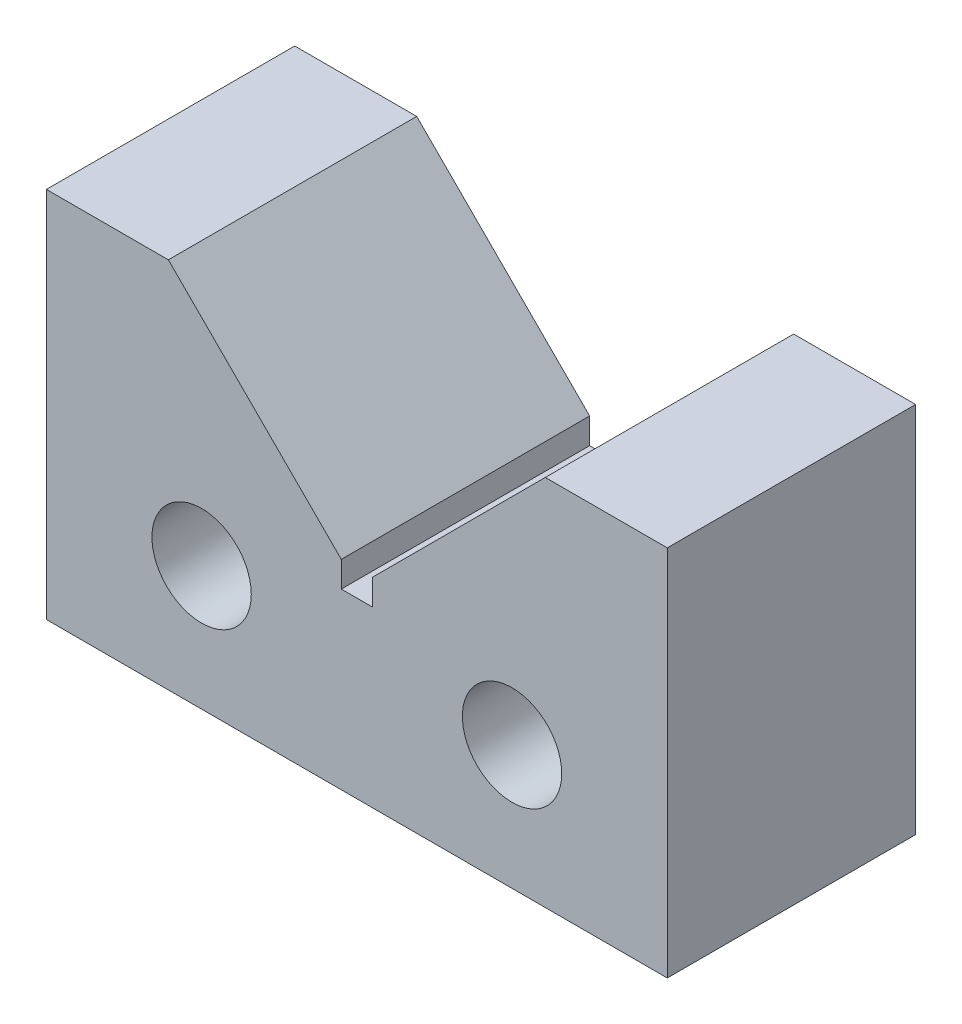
from build123d import *

# Parameters (mm, degrees)
SKETCH_3_W               = 100
SKETCH_3_H               = 60
EXTRUDE_1_DEPTH          = 40
CUT_EXTRUDE_1_DEPTH      = 88.749643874
CUT_EXTRUDE_1_DEPTH_BACK = 88.749643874
SKETCH_5_W               = 5
SKETCH_5_H               = 4.144660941
CUT_EXTRUDE_2_DEPTH      = 88.749643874
SKETCH_6_R               = 8
CUT_EXTRUDE_3_DEPTH      = 88.749643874


with BuildPart() as part:
    # Sketch 3 → Extrude 1 (new body)
    with BuildSketch(Plane.XY):
        with Locations((0, 30)):
            Rectangle(SKETCH_3_W, SKETCH_3_H)
    extrude(amount=EXTRUDE_1_DEPTH)

    # Sketch 4 → Cut-Extrude 1 (cut, two sides: drawn at the far end of the back side and taken through both)
    with BuildSketch(Plane.XY.offset(-CUT_EXTRUDE_1_DEPTH_BACK)):
        Polygon((-30.355339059, 60), (0, 29.644660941), (30.355339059, 60), align=None)
    extrude(amount=CUT_EXTRUDE_1_DEPTH + CUT_EXTRUDE_1_DEPTH_BACK, mode=Mode.SUBTRACT)

    # Sketch 5 → Cut-Extrude 2 (cut, through all)
    with BuildSketch(Plane.XY.offset(40)):
        with Locations((0, 30.072330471)):
            Rectangle(SKETCH_5_W, SKETCH_5_H)
    extrude(amount=-CUT_EXTRUDE_2_DEPTH, mode=Mode.SUBTRACT)

    # Sketch 6 → Cut-Extrude 3 (cut, through all)
    with BuildSketch(Plane.XY.offset(40)):
        with Locations((-25, 20)):
            Circle(SKETCH_6_R)
        with Locations((25, 20)):
            Circle(SKETCH_6_R)
    extrude(amount=-CUT_EXTRUDE_3_DEPTH, mode=Mode.SUBTRACT)


solid = part.part
